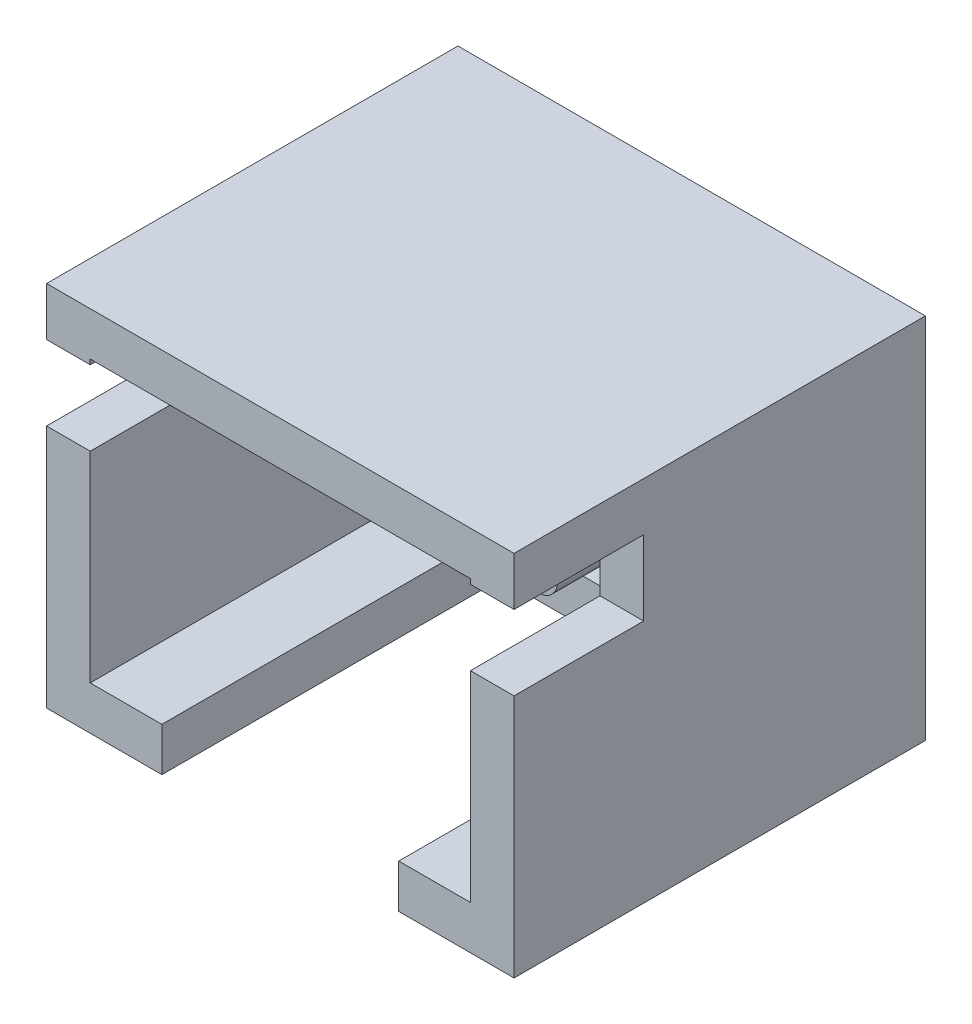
ISO-10303-21;
HEADER;
FILE_DESCRIPTION(('STEP AP214'),'2;1');
FILE_NAME('part.step','',(''),(''),'','','');
FILE_SCHEMA(('AUTOMOTIVE_DESIGN { 1 0 10303 214 1 1 1 1 }'));
ENDSEC;
DATA;
#1=APPLICATION_CONTEXT('core data for automotive mechanical design processes');
#2=APPLICATION_PROTOCOL_DEFINITION('international standard','automotive_design',2000,#1);
#3=PRODUCT_CONTEXT('',#1,'mechanical');
#4=PRODUCT('Part','Part','',(#3));
#5=PRODUCT_RELATED_PRODUCT_CATEGORY('part','',(#4));
#6=PRODUCT_DEFINITION_FORMATION('','',#4);
#7=PRODUCT_DEFINITION_CONTEXT('part definition',#1,'design');
#8=PRODUCT_DEFINITION('design','',#6,#7);
#9=PRODUCT_DEFINITION_SHAPE('','',#8);
#10=(LENGTH_UNIT() NAMED_UNIT(*) SI_UNIT(.MILLI.,.METRE.));
#11=(NAMED_UNIT(*) PLANE_ANGLE_UNIT() SI_UNIT($,.RADIAN.));
#12=(NAMED_UNIT(*) SI_UNIT($,.STERADIAN.) SOLID_ANGLE_UNIT());
#13=UNCERTAINTY_MEASURE_WITH_UNIT(LENGTH_MEASURE(1.E-05),#10,'distance_accuracy_value','');
#14=(GEOMETRIC_REPRESENTATION_CONTEXT(3) GLOBAL_UNCERTAINTY_ASSIGNED_CONTEXT((#13)) GLOBAL_UNIT_ASSIGNED_CONTEXT((#10,
#11,#12)) REPRESENTATION_CONTEXT('',''));
#15=CARTESIAN_POINT('',(0.,0.,0.));
#16=DIRECTION('',(0.,0.,1.));
#17=DIRECTION('',(1.,0.,0.));
#18=AXIS2_PLACEMENT_3D('',#15,#16,#17);
#19=CARTESIAN_POINT('',(26.7272344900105,4.7,0.));
#20=DIRECTION('',(0.,0.,-1.));
#21=DIRECTION('',(-1.,0.,0.));
#22=AXIS2_PLACEMENT_3D('',#19,#20,#21);
#23=PLANE('',#22);
#24=CARTESIAN_POINT('',(29.2202505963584,1.75,0.));
#25=DIRECTION('',(0.,0.,-1.));
#26=DIRECTION('',(-1.,0.,0.));
#27=AXIS2_PLACEMENT_3D('',#24,#25,#26);
#28=CIRCLE('',#27,0.302875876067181);
#29=CARTESIAN_POINT('',(28.9173747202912,1.75,0.));
#30=VERTEX_POINT('',#29);
#31=EDGE_CURVE('E397',#30,#30,#28,.F.);
#32=ORIENTED_EDGE('',*,*,#31,.T.);
#33=EDGE_LOOP('',(#32));
#34=FACE_BOUND('',#33,.T.);
#35=DIRECTION('',(0.,-1.,0.));
#36=VECTOR('',#35,1.);
#37=CARTESIAN_POINT('',(26.7272344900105,-1.2,0.));
#38=LINE('',#37,#36);
#39=CARTESIAN_POINT('',(26.7272344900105,4.7,0.));
#40=VERTEX_POINT('',#39);
#41=CARTESIAN_POINT('',(26.7272344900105,-1.2,0.));
#42=VERTEX_POINT('',#41);
#43=EDGE_CURVE('E330',#40,#42,#38,.T.);
#44=ORIENTED_EDGE('',*,*,#43,.F.);
#45=DIRECTION('',(-1.,0.,0.));
#46=VECTOR('',#45,1.);
#47=CARTESIAN_POINT('',(26.7272344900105,4.7,0.));
#48=LINE('',#47,#46);
#49=CARTESIAN_POINT('',(34.2272344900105,4.7,0.));
#50=VERTEX_POINT('',#49);
#51=EDGE_CURVE('E363',#50,#40,#48,.T.);
#52=ORIENTED_EDGE('',*,*,#51,.F.);
#53=DIRECTION('',(0.,1.,0.));
#54=VECTOR('',#53,1.);
#55=CARTESIAN_POINT('',(34.2272344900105,-1.2,0.));
#56=LINE('',#55,#54);
#57=CARTESIAN_POINT('',(34.2272344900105,-1.2,0.));
#58=VERTEX_POINT('',#57);
#59=EDGE_CURVE('E362',#58,#50,#56,.T.);
#60=ORIENTED_EDGE('',*,*,#59,.F.);
#61=DIRECTION('',(1.,0.,0.));
#62=VECTOR('',#61,1.);
#63=CARTESIAN_POINT('',(26.7272344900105,-1.2,0.));
#64=LINE('',#63,#62);
#65=EDGE_CURVE('E360',#42,#58,#64,.T.);
#66=ORIENTED_EDGE('',*,*,#65,.F.);
#67=EDGE_LOOP('',(#44,#52,#60,#66));
#68=FACE_BOUND('',#67,.T.);
#69=CARTESIAN_POINT('',(31.7202505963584,1.75,0.));
#70=DIRECTION('',(0.,0.,-1.));
#71=DIRECTION('',(-1.,0.,0.));
#72=AXIS2_PLACEMENT_3D('',#69,#70,#71);
#73=CIRCLE('',#72,0.302875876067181);
#74=CARTESIAN_POINT('',(31.4173747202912,1.75,0.));
#75=VERTEX_POINT('',#74);
#76=EDGE_CURVE('E571',#75,#75,#73,.F.);
#77=ORIENTED_EDGE('',*,*,#76,.T.);
#78=EDGE_LOOP('',(#77));
#79=FACE_BOUND('',#78,.T.);
#80=ADVANCED_FACE('F31',(#34,#68,#79),#23,.T.);
#81=CARTESIAN_POINT('',(26.7272344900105,4.7,0.7));
#82=DIRECTION('',(0.,0.,-1.));
#83=DIRECTION('',(-1.,0.,0.));
#84=AXIS2_PLACEMENT_3D('',#81,#82,#83);
#85=PLANE('',#84);
#86=CARTESIAN_POINT('',(29.2202505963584,1.75,0.7));
#87=DIRECTION('',(0.,0.,-1.));
#88=DIRECTION('',(-1.,0.,0.));
#89=AXIS2_PLACEMENT_3D('',#86,#87,#88);
#90=CIRCLE('',#89,0.302875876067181);
#91=CARTESIAN_POINT('',(28.9173747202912,1.75,0.7));
#92=VERTEX_POINT('',#91);
#93=EDGE_CURVE('E39',#92,#92,#90,.F.);
#94=ORIENTED_EDGE('',*,*,#93,.F.);
#95=EDGE_LOOP('',(#94));
#96=FACE_BOUND('',#95,.T.);
#97=DIRECTION('',(0.,-1.,0.));
#98=VECTOR('',#97,1.);
#99=CARTESIAN_POINT('',(27.4272344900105,4.7,0.7));
#100=LINE('',#99,#98);
#101=CARTESIAN_POINT('',(27.4272344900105,4.,0.7));
#102=VERTEX_POINT('',#101);
#103=CARTESIAN_POINT('',(27.4272344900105,-0.500000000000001,0.7));
#104=VERTEX_POINT('',#103);
#105=EDGE_CURVE('E236',#102,#104,#100,.T.);
#106=ORIENTED_EDGE('',*,*,#105,.T.);
#107=DIRECTION('',(1.,0.,0.));
#108=VECTOR('',#107,1.);
#109=CARTESIAN_POINT('',(26.7272344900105,-0.500000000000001,0.7));
#110=LINE('',#109,#108);
#111=CARTESIAN_POINT('',(33.5272344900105,-0.500000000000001,0.7));
#112=VERTEX_POINT('',#111);
#113=EDGE_CURVE('E326',#104,#112,#110,.T.);
#114=ORIENTED_EDGE('',*,*,#113,.T.);
#115=DIRECTION('',(0.,1.,0.));
#116=VECTOR('',#115,1.);
#117=CARTESIAN_POINT('',(33.5272344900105,4.7,0.7));
#118=LINE('',#117,#116);
#119=CARTESIAN_POINT('',(33.5272344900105,4.,0.7));
#120=VERTEX_POINT('',#119);
#121=EDGE_CURVE('E338',#112,#120,#118,.T.);
#122=ORIENTED_EDGE('',*,*,#121,.T.);
#123=DIRECTION('',(-1.,0.,0.));
#124=VECTOR('',#123,1.);
#125=CARTESIAN_POINT('',(26.7272344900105,4.,0.7));
#126=LINE('',#125,#124);
#127=EDGE_CURVE('E342',#120,#102,#126,.T.);
#128=ORIENTED_EDGE('',*,*,#127,.T.);
#129=EDGE_LOOP('',(#106,#114,#122,#128));
#130=FACE_BOUND('',#129,.T.);
#131=CARTESIAN_POINT('',(31.7202505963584,1.75,0.7));
#132=DIRECTION('',(0.,0.,-1.));
#133=DIRECTION('',(-1.,0.,0.));
#134=AXIS2_PLACEMENT_3D('',#131,#132,#133);
#135=CIRCLE('',#134,0.302875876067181);
#136=CARTESIAN_POINT('',(31.4173747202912,1.75,0.7));
#137=VERTEX_POINT('',#136);
#138=EDGE_CURVE('E11',#137,#137,#135,.F.);
#139=ORIENTED_EDGE('',*,*,#138,.F.);
#140=EDGE_LOOP('',(#139));
#141=FACE_BOUND('',#140,.T.);
#142=ADVANCED_FACE('F229',(#96,#130,#141),#85,.F.);
#143=CARTESIAN_POINT('',(26.7272344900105,4.7,6.6));
#144=DIRECTION('',(0.,0.,-1.));
#145=DIRECTION('',(-1.,0.,0.));
#146=AXIS2_PLACEMENT_3D('',#143,#144,#145);
#147=PLANE('',#146);
#148=DIRECTION('',(1.,0.,0.));
#149=VECTOR('',#148,1.);
#150=CARTESIAN_POINT('',(26.7272344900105,-1.2,6.6));
#151=LINE('',#150,#149);
#152=CARTESIAN_POINT('',(26.7272344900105,-1.2,6.6));
#153=VERTEX_POINT('',#152);
#154=CARTESIAN_POINT('',(28.5772344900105,-1.2,6.6));
#155=VERTEX_POINT('',#154);
#156=EDGE_CURVE('E187',#153,#155,#151,.T.);
#157=ORIENTED_EDGE('',*,*,#156,.T.);
#158=DIRECTION('',(0.,-1.,0.));
#159=VECTOR('',#158,1.);
#160=CARTESIAN_POINT('',(28.5772344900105,4.701,6.6));
#161=LINE('',#160,#159);
#162=CARTESIAN_POINT('',(28.5772344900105,-0.500000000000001,6.6));
#163=VERTEX_POINT('',#162);
#164=EDGE_CURVE('E168',#163,#155,#161,.T.);
#165=ORIENTED_EDGE('',*,*,#164,.F.);
#166=DIRECTION('',(1.,0.,0.));
#167=VECTOR('',#166,1.);
#168=CARTESIAN_POINT('',(26.7272344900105,-0.500000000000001,6.6));
#169=LINE('',#168,#167);
#170=CARTESIAN_POINT('',(27.4272344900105,-0.500000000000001,6.6));
#171=VERTEX_POINT('',#170);
#172=EDGE_CURVE('E351',#171,#163,#169,.T.);
#173=ORIENTED_EDGE('',*,*,#172,.F.);
#174=DIRECTION('',(0.,-1.,0.));
#175=VECTOR('',#174,1.);
#176=CARTESIAN_POINT('',(27.4272344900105,4.7,6.6));
#177=LINE('',#176,#175);
#178=CARTESIAN_POINT('',(27.4272344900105,2.72015732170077,6.6));
#179=VERTEX_POINT('',#178);
#180=EDGE_CURVE('E346',#179,#171,#177,.T.);
#181=ORIENTED_EDGE('',*,*,#180,.F.);
#182=DIRECTION('',(1.,0.,0.));
#183=VECTOR('',#182,1.);
#184=CARTESIAN_POINT('',(26.7272344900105,2.72015732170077,6.6));
#185=LINE('',#184,#183);
#186=CARTESIAN_POINT('',(26.7272344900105,2.72015732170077,6.6));
#187=VERTEX_POINT('',#186);
#188=EDGE_CURVE('E54',#187,#179,#185,.T.);
#189=ORIENTED_EDGE('',*,*,#188,.F.);
#190=DIRECTION('',(0.,-1.,0.));
#191=VECTOR('',#190,1.);
#192=CARTESIAN_POINT('',(26.7272344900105,-1.2,6.6));
#193=LINE('',#192,#191);
#194=EDGE_CURVE('E194',#187,#153,#193,.T.);
#195=ORIENTED_EDGE('',*,*,#194,.T.);
#196=EDGE_LOOP('',(#157,#165,#173,#181,#189,#195));
#197=FACE_BOUND('',#196,.T.);
#198=ADVANCED_FACE('F192',(#197),#147,.F.);
#199=CARTESIAN_POINT('',(26.7272344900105,4.7,6.6));
#200=VERTEX_POINT('',#199);
#201=CARTESIAN_POINT('',(26.7272344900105,3.92015732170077,6.6));
#202=VERTEX_POINT('',#201);
#203=EDGE_CURVE('E200',#200,#202,#193,.T.);
#204=ORIENTED_EDGE('',*,*,#203,.T.);
#205=DIRECTION('',(1.,0.,0.));
#206=VECTOR('',#205,1.);
#207=CARTESIAN_POINT('',(26.7272344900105,3.92015732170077,6.6));
#208=LINE('',#207,#206);
#209=CARTESIAN_POINT('',(27.4272344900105,3.92015732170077,6.6));
#210=VERTEX_POINT('',#209);
#211=EDGE_CURVE('E307',#202,#210,#208,.T.);
#212=ORIENTED_EDGE('',*,*,#211,.T.);
#213=CARTESIAN_POINT('',(27.4272344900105,4.,6.6));
#214=VERTEX_POINT('',#213);
#215=EDGE_CURVE('E347',#214,#210,#177,.T.);
#216=ORIENTED_EDGE('',*,*,#215,.F.);
#217=DIRECTION('',(-1.,0.,0.));
#218=VECTOR('',#217,1.);
#219=CARTESIAN_POINT('',(26.7272344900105,4.,6.6));
#220=LINE('',#219,#218);
#221=CARTESIAN_POINT('',(33.5272344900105,4.,6.6));
#222=VERTEX_POINT('',#221);
#223=EDGE_CURVE('E336',#222,#214,#220,.T.);
#224=ORIENTED_EDGE('',*,*,#223,.F.);
#225=DIRECTION('',(0.,1.,0.));
#226=VECTOR('',#225,1.);
#227=CARTESIAN_POINT('',(33.5272344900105,4.7,6.6));
#228=LINE('',#227,#226);
#229=CARTESIAN_POINT('',(33.5272344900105,3.92015732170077,6.6));
#230=VERTEX_POINT('',#229);
#231=EDGE_CURVE('E353',#230,#222,#228,.T.);
#232=ORIENTED_EDGE('',*,*,#231,.F.);
#233=CARTESIAN_POINT('',(34.2272344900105,3.92015732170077,6.6));
#234=VERTEX_POINT('',#233);
#235=EDGE_CURVE('E311',#230,#234,#208,.T.);
#236=ORIENTED_EDGE('',*,*,#235,.T.);
#237=DIRECTION('',(0.,1.,0.));
#238=VECTOR('',#237,1.);
#239=CARTESIAN_POINT('',(34.2272344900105,-1.2,6.6));
#240=LINE('',#239,#238);
#241=CARTESIAN_POINT('',(34.2272344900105,4.7,6.6));
#242=VERTEX_POINT('',#241);
#243=EDGE_CURVE('E195',#234,#242,#240,.T.);
#244=ORIENTED_EDGE('',*,*,#243,.T.);
#245=DIRECTION('',(-1.,0.,0.));
#246=VECTOR('',#245,1.);
#247=CARTESIAN_POINT('',(26.7272344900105,4.7,6.6));
#248=LINE('',#247,#246);
#249=EDGE_CURVE('E205',#242,#200,#248,.T.);
#250=ORIENTED_EDGE('',*,*,#249,.T.);
#251=EDGE_LOOP('',(#204,#212,#216,#224,#232,#236,#244,#250));
#252=FACE_BOUND('',#251,.T.);
#253=ADVANCED_FACE('F269',(#252),#147,.F.);
#254=CARTESIAN_POINT('',(32.3772344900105,-0.500000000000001,6.6));
#255=VERTEX_POINT('',#254);
#256=CARTESIAN_POINT('',(33.5272344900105,-0.500000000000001,6.6));
#257=VERTEX_POINT('',#256);
#258=EDGE_CURVE('E350',#255,#257,#169,.T.);
#259=ORIENTED_EDGE('',*,*,#258,.F.);
#260=DIRECTION('',(0.,-1.,0.));
#261=VECTOR('',#260,1.);
#262=CARTESIAN_POINT('',(32.3772344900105,4.701,6.6));
#263=LINE('',#262,#261);
#264=CARTESIAN_POINT('',(32.3772344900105,-1.2,6.6));
#265=VERTEX_POINT('',#264);
#266=EDGE_CURVE('E385',#255,#265,#263,.T.);
#267=ORIENTED_EDGE('',*,*,#266,.T.);
#268=CARTESIAN_POINT('',(34.2272344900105,-1.2,6.6));
#269=VERTEX_POINT('',#268);
#270=EDGE_CURVE('E196',#265,#269,#151,.T.);
#271=ORIENTED_EDGE('',*,*,#270,.T.);
#272=CARTESIAN_POINT('',(34.2272344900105,2.72015732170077,6.6));
#273=VERTEX_POINT('',#272);
#274=EDGE_CURVE('E198',#269,#273,#240,.T.);
#275=ORIENTED_EDGE('',*,*,#274,.T.);
#276=CARTESIAN_POINT('',(33.5272344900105,2.72015732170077,6.6));
#277=VERTEX_POINT('',#276);
#278=EDGE_CURVE('E301',#277,#273,#185,.T.);
#279=ORIENTED_EDGE('',*,*,#278,.F.);
#280=EDGE_CURVE('E354',#257,#277,#228,.T.);
#281=ORIENTED_EDGE('',*,*,#280,.F.);
#282=EDGE_LOOP('',(#259,#267,#271,#275,#279,#281));
#283=FACE_BOUND('',#282,.T.);
#284=ADVANCED_FACE('F266',(#283),#147,.F.);
#285=CARTESIAN_POINT('',(26.7272344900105,-1.2,6.6));
#286=DIRECTION('',(1.,0.,0.));
#287=DIRECTION('',(0.,0.,-1.));
#288=AXIS2_PLACEMENT_3D('',#285,#286,#287);
#289=PLANE('',#288);
#290=DIRECTION('',(0.,1.,0.));
#291=VECTOR('',#290,1.);
#292=CARTESIAN_POINT('',(26.7272344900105,2.72015732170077,4.52038481));
#293=LINE('',#292,#291);
#294=CARTESIAN_POINT('',(26.7272344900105,2.72015732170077,4.52038481));
#295=VERTEX_POINT('',#294);
#296=CARTESIAN_POINT('',(26.7272344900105,3.92015732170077,4.52038481));
#297=VERTEX_POINT('',#296);
#298=EDGE_CURVE('E292',#295,#297,#293,.T.);
#299=ORIENTED_EDGE('',*,*,#298,.T.);
#300=DIRECTION('',(0.,0.,1.));
#301=VECTOR('',#300,1.);
#302=CARTESIAN_POINT('',(26.7272344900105,3.92015732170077,6.6));
#303=LINE('',#302,#301);
#304=EDGE_CURVE('E295',#297,#202,#303,.T.);
#305=ORIENTED_EDGE('',*,*,#304,.T.);
#306=ORIENTED_EDGE('',*,*,#203,.F.);
#307=DIRECTION('',(0.,0.,-1.));
#308=VECTOR('',#307,1.);
#309=CARTESIAN_POINT('',(26.7272344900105,4.7,6.6));
#310=LINE('',#309,#308);
#311=EDGE_CURVE('E207',#200,#40,#310,.T.);
#312=ORIENTED_EDGE('',*,*,#311,.T.);
#313=ORIENTED_EDGE('',*,*,#43,.T.);
#314=DIRECTION('',(0.,0.,-1.));
#315=VECTOR('',#314,1.);
#316=CARTESIAN_POINT('',(26.7272344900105,-1.2,6.6));
#317=LINE('',#316,#315);
#318=EDGE_CURVE('E216',#153,#42,#317,.T.);
#319=ORIENTED_EDGE('',*,*,#318,.F.);
#320=ORIENTED_EDGE('',*,*,#194,.F.);
#321=DIRECTION('',(0.,0.,-1.));
#322=VECTOR('',#321,1.);
#323=CARTESIAN_POINT('',(26.7272344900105,2.72015732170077,6.6));
#324=LINE('',#323,#322);
#325=EDGE_CURVE('E297',#187,#295,#324,.T.);
#326=ORIENTED_EDGE('',*,*,#325,.T.);
#327=EDGE_LOOP('',(#299,#305,#306,#312,#313,#319,#320,#326));
#328=FACE_BOUND('',#327,.T.);
#329=ADVANCED_FACE('F33',(#328),#289,.F.);
#330=CARTESIAN_POINT('',(26.7272344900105,-1.2,6.6));
#331=DIRECTION('',(0.,1.,0.));
#332=DIRECTION('',(0.,0.,1.));
#333=AXIS2_PLACEMENT_3D('',#330,#331,#332);
#334=PLANE('',#333);
#335=DIRECTION('',(1.,0.,0.));
#336=VECTOR('',#335,1.);
#337=CARTESIAN_POINT('',(28.5772344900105,-1.2,1.16189975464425));
#338=LINE('',#337,#336);
#339=CARTESIAN_POINT('',(28.5772344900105,-1.2,1.16189975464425));
#340=VERTEX_POINT('',#339);
#341=CARTESIAN_POINT('',(32.3772344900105,-1.2,1.16189975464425));
#342=VERTEX_POINT('',#341);
#343=EDGE_CURVE('E190',#340,#342,#338,.T.);
#344=ORIENTED_EDGE('',*,*,#343,.F.);
#345=DIRECTION('',(0.,0.,-1.));
#346=VECTOR('',#345,1.);
#347=CARTESIAN_POINT('',(28.5772344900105,-1.2,6.6));
#348=LINE('',#347,#346);
#349=EDGE_CURVE('E172',#155,#340,#348,.T.);
#350=ORIENTED_EDGE('',*,*,#349,.F.);
#351=ORIENTED_EDGE('',*,*,#156,.F.);
#352=ORIENTED_EDGE('',*,*,#318,.T.);
#353=ORIENTED_EDGE('',*,*,#65,.T.);
#354=DIRECTION('',(0.,0.,-1.));
#355=VECTOR('',#354,1.);
#356=CARTESIAN_POINT('',(34.2272344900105,-1.2,6.6));
#357=LINE('',#356,#355);
#358=EDGE_CURVE('E213',#269,#58,#357,.T.);
#359=ORIENTED_EDGE('',*,*,#358,.F.);
#360=ORIENTED_EDGE('',*,*,#270,.F.);
#361=DIRECTION('',(0.,0.,1.));
#362=VECTOR('',#361,1.);
#363=CARTESIAN_POINT('',(32.3772344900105,-1.2,6.6));
#364=LINE('',#363,#362);
#365=EDGE_CURVE('E386',#342,#265,#364,.T.);
#366=ORIENTED_EDGE('',*,*,#365,.F.);
#367=EDGE_LOOP('',(#344,#350,#351,#352,#353,#359,#360,#366));
#368=FACE_BOUND('',#367,.T.);
#369=ADVANCED_FACE('F185',(#368),#334,.F.);
#370=CARTESIAN_POINT('',(34.2272344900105,-1.2,6.6));
#371=DIRECTION('',(-1.,0.,0.));
#372=DIRECTION('',(0.,0.,1.));
#373=AXIS2_PLACEMENT_3D('',#370,#371,#372);
#374=PLANE('',#373);
#375=ORIENTED_EDGE('',*,*,#243,.F.);
#376=DIRECTION('',(0.,0.,1.));
#377=VECTOR('',#376,1.);
#378=CARTESIAN_POINT('',(34.2272344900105,3.92015732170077,6.6));
#379=LINE('',#378,#377);
#380=CARTESIAN_POINT('',(34.2272344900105,3.92015732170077,4.52038481));
#381=VERTEX_POINT('',#380);
#382=EDGE_CURVE('E303',#381,#234,#379,.T.);
#383=ORIENTED_EDGE('',*,*,#382,.F.);
#384=DIRECTION('',(0.,1.,0.));
#385=VECTOR('',#384,1.);
#386=CARTESIAN_POINT('',(34.2272344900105,2.72015732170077,4.52038481));
#387=LINE('',#386,#385);
#388=CARTESIAN_POINT('',(34.2272344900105,2.72015732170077,4.52038481));
#389=VERTEX_POINT('',#388);
#390=EDGE_CURVE('E389',#389,#381,#387,.T.);
#391=ORIENTED_EDGE('',*,*,#390,.F.);
#392=DIRECTION('',(0.,0.,-1.));
#393=VECTOR('',#392,1.);
#394=CARTESIAN_POINT('',(34.2272344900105,2.72015732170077,6.6));
#395=LINE('',#394,#393);
#396=EDGE_CURVE('E380',#273,#389,#395,.T.);
#397=ORIENTED_EDGE('',*,*,#396,.F.);
#398=ORIENTED_EDGE('',*,*,#274,.F.);
#399=ORIENTED_EDGE('',*,*,#358,.T.);
#400=ORIENTED_EDGE('',*,*,#59,.T.);
#401=DIRECTION('',(0.,0.,-1.));
#402=VECTOR('',#401,1.);
#403=CARTESIAN_POINT('',(34.2272344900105,4.7,6.6));
#404=LINE('',#403,#402);
#405=EDGE_CURVE('E210',#242,#50,#404,.T.);
#406=ORIENTED_EDGE('',*,*,#405,.F.);
#407=EDGE_LOOP('',(#375,#383,#391,#397,#398,#399,#400,#406));
#408=FACE_BOUND('',#407,.T.);
#409=ADVANCED_FACE('F275',(#408),#374,.F.);
#410=CARTESIAN_POINT('',(26.7272344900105,4.7,6.6));
#411=DIRECTION('',(0.,-1.,0.));
#412=DIRECTION('',(0.,0.,-1.));
#413=AXIS2_PLACEMENT_3D('',#410,#411,#412);
#414=PLANE('',#413);
#415=ORIENTED_EDGE('',*,*,#51,.T.);
#416=ORIENTED_EDGE('',*,*,#311,.F.);
#417=ORIENTED_EDGE('',*,*,#249,.F.);
#418=ORIENTED_EDGE('',*,*,#405,.T.);
#419=EDGE_LOOP('',(#415,#416,#417,#418));
#420=FACE_BOUND('',#419,.T.);
#421=ADVANCED_FACE('F271',(#420),#414,.F.);
#422=CARTESIAN_POINT('',(27.4272344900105,-1.2,6.6));
#423=DIRECTION('',(1.,0.,0.));
#424=DIRECTION('',(0.,0.,-1.));
#425=AXIS2_PLACEMENT_3D('',#422,#423,#424);
#426=PLANE('',#425);
#427=DIRECTION('',(0.,0.,1.));
#428=VECTOR('',#427,1.);
#429=CARTESIAN_POINT('',(27.4272344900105,3.92015732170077,6.6));
#430=LINE('',#429,#428);
#431=CARTESIAN_POINT('',(27.4272344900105,3.92015732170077,4.52038481));
#432=VERTEX_POINT('',#431);
#433=EDGE_CURVE('E323',#432,#210,#430,.T.);
#434=ORIENTED_EDGE('',*,*,#433,.F.);
#435=DIRECTION('',(0.,1.,0.));
#436=VECTOR('',#435,1.);
#437=CARTESIAN_POINT('',(27.4272344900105,-1.2,4.52038481));
#438=LINE('',#437,#436);
#439=CARTESIAN_POINT('',(27.4272344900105,2.72015732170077,4.52038481));
#440=VERTEX_POINT('',#439);
#441=EDGE_CURVE('E321',#440,#432,#438,.T.);
#442=ORIENTED_EDGE('',*,*,#441,.F.);
#443=DIRECTION('',(0.,0.,-1.));
#444=VECTOR('',#443,1.);
#445=CARTESIAN_POINT('',(27.4272344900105,2.72015732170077,6.6));
#446=LINE('',#445,#444);
#447=EDGE_CURVE('E310',#179,#440,#446,.T.);
#448=ORIENTED_EDGE('',*,*,#447,.F.);
#449=ORIENTED_EDGE('',*,*,#180,.T.);
#450=DIRECTION('',(0.,0.,-1.));
#451=VECTOR('',#450,1.);
#452=CARTESIAN_POINT('',(27.4272344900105,-0.500000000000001,6.6));
#453=LINE('',#452,#451);
#454=EDGE_CURVE('E327',#171,#104,#453,.T.);
#455=ORIENTED_EDGE('',*,*,#454,.T.);
#456=ORIENTED_EDGE('',*,*,#105,.F.);
#457=DIRECTION('',(0.,0.,-1.));
#458=VECTOR('',#457,1.);
#459=CARTESIAN_POINT('',(27.4272344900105,4.,6.6));
#460=LINE('',#459,#458);
#461=EDGE_CURVE('E332',#214,#102,#460,.T.);
#462=ORIENTED_EDGE('',*,*,#461,.F.);
#463=ORIENTED_EDGE('',*,*,#215,.T.);
#464=EDGE_LOOP('',(#434,#442,#448,#449,#455,#456,#462,#463));
#465=FACE_BOUND('',#464,.T.);
#466=ADVANCED_FACE('F274',(#465),#426,.T.);
#467=CARTESIAN_POINT('',(26.7272344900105,-0.500000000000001,6.6));
#468=DIRECTION('',(0.,1.,0.));
#469=DIRECTION('',(0.,0.,1.));
#470=AXIS2_PLACEMENT_3D('',#467,#468,#469);
#471=PLANE('',#470);
#472=DIRECTION('',(0.,0.,-1.));
#473=VECTOR('',#472,1.);
#474=CARTESIAN_POINT('',(28.5772344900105,-0.500000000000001,6.6));
#475=LINE('',#474,#473);
#476=CARTESIAN_POINT('',(28.5772344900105,-0.500000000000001,1.16189975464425));
#477=VERTEX_POINT('',#476);
#478=EDGE_CURVE('E175',#163,#477,#475,.T.);
#479=ORIENTED_EDGE('',*,*,#478,.T.);
#480=DIRECTION('',(1.,0.,0.));
#481=VECTOR('',#480,1.);
#482=CARTESIAN_POINT('',(28.5772344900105,-0.500000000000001,1.16189975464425));
#483=LINE('',#482,#481);
#484=CARTESIAN_POINT('',(32.3772344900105,-0.500000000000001,1.16189975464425));
#485=VERTEX_POINT('',#484);
#486=EDGE_CURVE('E393',#477,#485,#483,.T.);
#487=ORIENTED_EDGE('',*,*,#486,.T.);
#488=DIRECTION('',(0.,0.,1.));
#489=VECTOR('',#488,1.);
#490=CARTESIAN_POINT('',(32.3772344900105,-0.500000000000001,6.6));
#491=LINE('',#490,#489);
#492=EDGE_CURVE('E180',#485,#255,#491,.T.);
#493=ORIENTED_EDGE('',*,*,#492,.T.);
#494=ORIENTED_EDGE('',*,*,#258,.T.);
#495=DIRECTION('',(0.,0.,-1.));
#496=VECTOR('',#495,1.);
#497=CARTESIAN_POINT('',(33.5272344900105,-0.500000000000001,6.6));
#498=LINE('',#497,#496);
#499=EDGE_CURVE('E331',#257,#112,#498,.T.);
#500=ORIENTED_EDGE('',*,*,#499,.T.);
#501=ORIENTED_EDGE('',*,*,#113,.F.);
#502=ORIENTED_EDGE('',*,*,#454,.F.);
#503=ORIENTED_EDGE('',*,*,#172,.T.);
#504=EDGE_LOOP('',(#479,#487,#493,#494,#500,#501,#502,#503));
#505=FACE_BOUND('',#504,.T.);
#506=ADVANCED_FACE('F424',(#505),#471,.T.);
#507=CARTESIAN_POINT('',(33.5272344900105,-1.2,6.6));
#508=DIRECTION('',(-1.,0.,0.));
#509=DIRECTION('',(0.,0.,1.));
#510=AXIS2_PLACEMENT_3D('',#507,#508,#509);
#511=PLANE('',#510);
#512=DIRECTION('',(0.,0.,-1.));
#513=VECTOR('',#512,1.);
#514=CARTESIAN_POINT('',(33.5272344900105,3.92015732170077,6.6));
#515=LINE('',#514,#513);
#516=CARTESIAN_POINT('',(33.5272344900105,3.92015732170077,4.52038481));
#517=VERTEX_POINT('',#516);
#518=EDGE_CURVE('E223',#230,#517,#515,.T.);
#519=ORIENTED_EDGE('',*,*,#518,.F.);
#520=ORIENTED_EDGE('',*,*,#231,.T.);
#521=DIRECTION('',(0.,0.,-1.));
#522=VECTOR('',#521,1.);
#523=CARTESIAN_POINT('',(33.5272344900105,4.,6.6));
#524=LINE('',#523,#522);
#525=EDGE_CURVE('E335',#222,#120,#524,.T.);
#526=ORIENTED_EDGE('',*,*,#525,.T.);
#527=ORIENTED_EDGE('',*,*,#121,.F.);
#528=ORIENTED_EDGE('',*,*,#499,.F.);
#529=ORIENTED_EDGE('',*,*,#280,.T.);
#530=DIRECTION('',(0.,0.,1.));
#531=VECTOR('',#530,1.);
#532=CARTESIAN_POINT('',(33.5272344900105,2.72015732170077,6.6));
#533=LINE('',#532,#531);
#534=CARTESIAN_POINT('',(33.5272344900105,2.72015732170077,4.52038481));
#535=VERTEX_POINT('',#534);
#536=EDGE_CURVE('E218',#535,#277,#533,.T.);
#537=ORIENTED_EDGE('',*,*,#536,.F.);
#538=DIRECTION('',(0.,-1.,0.));
#539=VECTOR('',#538,1.);
#540=CARTESIAN_POINT('',(33.5272344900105,-1.2,4.52038481));
#541=LINE('',#540,#539);
#542=EDGE_CURVE('E220',#517,#535,#541,.T.);
#543=ORIENTED_EDGE('',*,*,#542,.F.);
#544=EDGE_LOOP('',(#519,#520,#526,#527,#528,#529,#537,#543));
#545=FACE_BOUND('',#544,.T.);
#546=ADVANCED_FACE('F414',(#545),#511,.T.);
#547=CARTESIAN_POINT('',(26.7272344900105,4.,6.6));
#548=DIRECTION('',(0.,-1.,0.));
#549=DIRECTION('',(0.,0.,-1.));
#550=AXIS2_PLACEMENT_3D('',#547,#548,#549);
#551=PLANE('',#550);
#552=ORIENTED_EDGE('',*,*,#127,.F.);
#553=ORIENTED_EDGE('',*,*,#525,.F.);
#554=ORIENTED_EDGE('',*,*,#223,.T.);
#555=ORIENTED_EDGE('',*,*,#461,.T.);
#556=EDGE_LOOP('',(#552,#553,#554,#555));
#557=FACE_BOUND('',#556,.T.);
#558=ADVANCED_FACE('F419',(#557),#551,.T.);
#559=CARTESIAN_POINT('',(26.7272344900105,2.72015732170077,6.6));
#560=DIRECTION('',(0.,-1.,0.));
#561=DIRECTION('',(0.,0.,-1.));
#562=AXIS2_PLACEMENT_3D('',#559,#560,#561);
#563=PLANE('',#562);
#564=ORIENTED_EDGE('',*,*,#536,.T.);
#565=ORIENTED_EDGE('',*,*,#278,.T.);
#566=ORIENTED_EDGE('',*,*,#396,.T.);
#567=DIRECTION('',(1.,0.,0.));
#568=VECTOR('',#567,1.);
#569=CARTESIAN_POINT('',(26.7272344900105,2.72015732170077,4.52038481));
#570=LINE('',#569,#568);
#571=EDGE_CURVE('E318',#535,#389,#570,.T.);
#572=ORIENTED_EDGE('',*,*,#571,.F.);
#573=EDGE_LOOP('',(#564,#565,#566,#572));
#574=FACE_BOUND('',#573,.T.);
#575=ADVANCED_FACE('F449',(#574),#563,.F.);
#576=CARTESIAN_POINT('',(26.7272344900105,2.72015732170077,4.52038481));
#577=DIRECTION('',(0.,0.,-1.));
#578=DIRECTION('',(-1.,0.,0.));
#579=AXIS2_PLACEMENT_3D('',#576,#577,#578);
#580=PLANE('',#579);
#581=ORIENTED_EDGE('',*,*,#542,.T.);
#582=ORIENTED_EDGE('',*,*,#571,.T.);
#583=ORIENTED_EDGE('',*,*,#390,.T.);
#584=DIRECTION('',(1.,0.,0.));
#585=VECTOR('',#584,1.);
#586=CARTESIAN_POINT('',(26.7272344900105,3.92015732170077,4.52038481));
#587=LINE('',#586,#585);
#588=EDGE_CURVE('E315',#517,#381,#587,.T.);
#589=ORIENTED_EDGE('',*,*,#588,.F.);
#590=EDGE_LOOP('',(#581,#582,#583,#589));
#591=FACE_BOUND('',#590,.T.);
#592=ADVANCED_FACE('F444',(#591),#580,.F.);
#593=CARTESIAN_POINT('',(26.7272344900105,3.92015732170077,6.6));
#594=DIRECTION('',(0.,1.,0.));
#595=DIRECTION('',(0.,0.,1.));
#596=AXIS2_PLACEMENT_3D('',#593,#594,#595);
#597=PLANE('',#596);
#598=ORIENTED_EDGE('',*,*,#518,.T.);
#599=ORIENTED_EDGE('',*,*,#588,.T.);
#600=ORIENTED_EDGE('',*,*,#382,.T.);
#601=ORIENTED_EDGE('',*,*,#235,.F.);
#602=EDGE_LOOP('',(#598,#599,#600,#601));
#603=FACE_BOUND('',#602,.T.);
#604=ADVANCED_FACE('F407',(#603),#597,.F.);
#605=ORIENTED_EDGE('',*,*,#433,.T.);
#606=ORIENTED_EDGE('',*,*,#211,.F.);
#607=ORIENTED_EDGE('',*,*,#304,.F.);
#608=EDGE_CURVE('E312',#297,#432,#587,.T.);
#609=ORIENTED_EDGE('',*,*,#608,.T.);
#610=EDGE_LOOP('',(#605,#606,#607,#609));
#611=FACE_BOUND('',#610,.T.);
#612=ADVANCED_FACE('F436',(#611),#597,.F.);
#613=ORIENTED_EDGE('',*,*,#441,.T.);
#614=ORIENTED_EDGE('',*,*,#608,.F.);
#615=ORIENTED_EDGE('',*,*,#298,.F.);
#616=EDGE_CURVE('E316',#295,#440,#570,.T.);
#617=ORIENTED_EDGE('',*,*,#616,.T.);
#618=EDGE_LOOP('',(#613,#614,#615,#617));
#619=FACE_BOUND('',#618,.T.);
#620=ADVANCED_FACE('F434',(#619),#580,.F.);
#621=ORIENTED_EDGE('',*,*,#447,.T.);
#622=ORIENTED_EDGE('',*,*,#616,.F.);
#623=ORIENTED_EDGE('',*,*,#325,.F.);
#624=ORIENTED_EDGE('',*,*,#188,.T.);
#625=EDGE_LOOP('',(#621,#622,#623,#624));
#626=FACE_BOUND('',#625,.T.);
#627=ADVANCED_FACE('F433',(#626),#563,.F.);
#628=CARTESIAN_POINT('',(28.5772344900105,4.701,6.6));
#629=DIRECTION('',(-1.,0.,0.));
#630=DIRECTION('',(0.,-1.,0.));
#631=AXIS2_PLACEMENT_3D('',#628,#629,#630);
#632=PLANE('',#631);
#633=ORIENTED_EDGE('',*,*,#164,.T.);
#634=ORIENTED_EDGE('',*,*,#349,.T.);
#635=DIRECTION('',(0.,-1.,0.));
#636=VECTOR('',#635,1.);
#637=CARTESIAN_POINT('',(28.5772344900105,4.701,1.16189975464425));
#638=LINE('',#637,#636);
#639=EDGE_CURVE('E181',#477,#340,#638,.T.);
#640=ORIENTED_EDGE('',*,*,#639,.F.);
#641=ORIENTED_EDGE('',*,*,#478,.F.);
#642=EDGE_LOOP('',(#633,#634,#640,#641));
#643=FACE_BOUND('',#642,.T.);
#644=ADVANCED_FACE('F170',(#643),#632,.F.);
#645=CARTESIAN_POINT('',(32.3772344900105,4.701,6.6));
#646=DIRECTION('',(1.,0.,0.));
#647=DIRECTION('',(0.,1.,0.));
#648=AXIS2_PLACEMENT_3D('',#645,#646,#647);
#649=PLANE('',#648);
#650=DIRECTION('',(0.,-1.,0.));
#651=VECTOR('',#650,1.);
#652=CARTESIAN_POINT('',(32.3772344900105,4.701,1.16189975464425));
#653=LINE('',#652,#651);
#654=EDGE_CURVE('E46',#485,#342,#653,.T.);
#655=ORIENTED_EDGE('',*,*,#654,.T.);
#656=ORIENTED_EDGE('',*,*,#365,.T.);
#657=ORIENTED_EDGE('',*,*,#266,.F.);
#658=ORIENTED_EDGE('',*,*,#492,.F.);
#659=EDGE_LOOP('',(#655,#656,#657,#658));
#660=FACE_BOUND('',#659,.T.);
#661=ADVANCED_FACE('F426',(#660),#649,.F.);
#662=CARTESIAN_POINT('',(28.5772344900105,4.701,1.16189975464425));
#663=DIRECTION('',(0.,0.,-1.));
#664=DIRECTION('',(-1.,0.,0.));
#665=AXIS2_PLACEMENT_3D('',#662,#663,#664);
#666=PLANE('',#665);
#667=ORIENTED_EDGE('',*,*,#639,.T.);
#668=ORIENTED_EDGE('',*,*,#343,.T.);
#669=ORIENTED_EDGE('',*,*,#654,.F.);
#670=ORIENTED_EDGE('',*,*,#486,.F.);
#671=EDGE_LOOP('',(#667,#668,#669,#670));
#672=FACE_BOUND('',#671,.T.);
#673=ADVANCED_FACE('F427',(#672),#666,.F.);
#674=CARTESIAN_POINT('',(29.2202505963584,1.75,3.7));
#675=DIRECTION('',(0.,0.,1.));
#676=DIRECTION('',(1.,0.,0.));
#677=AXIS2_PLACEMENT_3D('',#674,#675,#676);
#678=PLANE('',#677);
#679=CARTESIAN_POINT('',(29.2202505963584,1.75,3.7));
#680=DIRECTION('',(0.,0.,1.));
#681=DIRECTION('',(1.,0.,0.));
#682=AXIS2_PLACEMENT_3D('',#679,#680,#681);
#683=CIRCLE('',#682,0.302875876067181);
#684=CARTESIAN_POINT('',(29.5231264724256,1.75,3.7));
#685=VERTEX_POINT('',#684);
#686=EDGE_CURVE('E579',#685,#685,#683,.T.);
#687=ORIENTED_EDGE('',*,*,#686,.T.);
#688=EDGE_LOOP('',(#687));
#689=FACE_BOUND('',#688,.T.);
#690=ADVANCED_FACE('F512',(#689),#678,.T.);
#691=CARTESIAN_POINT('',(29.2202505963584,1.75,3.7));
#692=DIRECTION('',(0.,0.,-1.));
#693=DIRECTION('',(-1.,0.,0.));
#694=AXIS2_PLACEMENT_3D('',#691,#692,#693);
#695=CYLINDRICAL_SURFACE('',#694,0.302875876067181);
#696=ORIENTED_EDGE('',*,*,#686,.F.);
#697=EDGE_LOOP('',(#696));
#698=FACE_BOUND('',#697,.T.);
#699=ORIENTED_EDGE('',*,*,#93,.T.);
#700=EDGE_LOOP('',(#699));
#701=FACE_BOUND('',#700,.T.);
#702=ADVANCED_FACE('F227',(#698,#701),#695,.T.);
#703=ORIENTED_EDGE('',*,*,#31,.F.);
#704=EDGE_LOOP('',(#703));
#705=FACE_BOUND('',#704,.T.);
#706=CARTESIAN_POINT('',(29.2202505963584,1.75,-1.3));
#707=DIRECTION('',(0.,0.,1.));
#708=DIRECTION('',(1.,0.,0.));
#709=AXIS2_PLACEMENT_3D('',#706,#707,#708);
#710=CIRCLE('',#709,0.302875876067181);
#711=CARTESIAN_POINT('',(29.5231264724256,1.75,-1.3));
#712=VERTEX_POINT('',#711);
#713=EDGE_CURVE('E576',#712,#712,#710,.T.);
#714=ORIENTED_EDGE('',*,*,#713,.T.);
#715=EDGE_LOOP('',(#714));
#716=FACE_BOUND('',#715,.T.);
#717=ADVANCED_FACE('F532',(#705,#716),#695,.T.);
#718=CARTESIAN_POINT('',(29.2202505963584,1.75,-1.3));
#719=DIRECTION('',(0.,0.,1.));
#720=DIRECTION('',(1.,0.,0.));
#721=AXIS2_PLACEMENT_3D('',#718,#719,#720);
#722=PLANE('',#721);
#723=ORIENTED_EDGE('',*,*,#713,.F.);
#724=EDGE_LOOP('',(#723));
#725=FACE_BOUND('',#724,.T.);
#726=ADVANCED_FACE('F251',(#725),#722,.F.);
#727=CARTESIAN_POINT('',(31.7202505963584,1.75,3.7));
#728=DIRECTION('',(0.,0.,1.));
#729=DIRECTION('',(1.,0.,0.));
#730=AXIS2_PLACEMENT_3D('',#727,#728,#729);
#731=PLANE('',#730);
#732=CARTESIAN_POINT('',(31.7202505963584,1.75,3.7));
#733=DIRECTION('',(0.,0.,1.));
#734=DIRECTION('',(1.,0.,0.));
#735=AXIS2_PLACEMENT_3D('',#732,#733,#734);
#736=CIRCLE('',#735,0.302875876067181);
#737=CARTESIAN_POINT('',(32.0231264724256,1.75,3.7));
#738=VERTEX_POINT('',#737);
#739=EDGE_CURVE('E568',#738,#738,#736,.T.);
#740=ORIENTED_EDGE('',*,*,#739,.T.);
#741=EDGE_LOOP('',(#740));
#742=FACE_BOUND('',#741,.T.);
#743=ADVANCED_FACE('F242',(#742),#731,.T.);
#744=CARTESIAN_POINT('',(31.7202505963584,1.75,3.7));
#745=DIRECTION('',(0.,0.,-1.));
#746=DIRECTION('',(-1.,0.,0.));
#747=AXIS2_PLACEMENT_3D('',#744,#745,#746);
#748=CYLINDRICAL_SURFACE('',#747,0.302875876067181);
#749=ORIENTED_EDGE('',*,*,#739,.F.);
#750=EDGE_LOOP('',(#749));
#751=FACE_BOUND('',#750,.T.);
#752=ORIENTED_EDGE('',*,*,#138,.T.);
#753=EDGE_LOOP('',(#752));
#754=FACE_BOUND('',#753,.T.);
#755=ADVANCED_FACE('F239',(#751,#754),#748,.T.);
#756=ORIENTED_EDGE('',*,*,#76,.F.);
#757=EDGE_LOOP('',(#756));
#758=FACE_BOUND('',#757,.T.);
#759=CARTESIAN_POINT('',(31.7202505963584,1.75,-1.3));
#760=DIRECTION('',(0.,0.,1.));
#761=DIRECTION('',(1.,0.,0.));
#762=AXIS2_PLACEMENT_3D('',#759,#760,#761);
#763=CIRCLE('',#762,0.302875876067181);
#764=CARTESIAN_POINT('',(32.0231264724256,1.75,-1.3));
#765=VERTEX_POINT('',#764);
#766=EDGE_CURVE('E566',#765,#765,#763,.T.);
#767=ORIENTED_EDGE('',*,*,#766,.T.);
#768=EDGE_LOOP('',(#767));
#769=FACE_BOUND('',#768,.T.);
#770=ADVANCED_FACE('F241',(#758,#769),#748,.T.);
#771=CARTESIAN_POINT('',(31.7202505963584,1.75,-1.3));
#772=DIRECTION('',(0.,0.,1.));
#773=DIRECTION('',(1.,0.,0.));
#774=AXIS2_PLACEMENT_3D('',#771,#772,#773);
#775=PLANE('',#774);
#776=ORIENTED_EDGE('',*,*,#766,.F.);
#777=EDGE_LOOP('',(#776));
#778=FACE_BOUND('',#777,.T.);
#779=ADVANCED_FACE('F249',(#778),#775,.F.);
#780=CLOSED_SHELL('',(#80,#142,#198,#253,#284,#329,#369,#409,#421,#466,#506,#546,#558,#575,#592,
#604,#612,#620,#627,#644,#661,#673,#690,#702,#717,#726,#743,#755,#770,#779));
#781=MANIFOLD_SOLID_BREP('B2',#780);
#782=ADVANCED_BREP_SHAPE_REPRESENTATION('',(#18,#781),#14);
#783=SHAPE_DEFINITION_REPRESENTATION(#9,#782);
ENDSEC;
END-ISO-10303-21;
